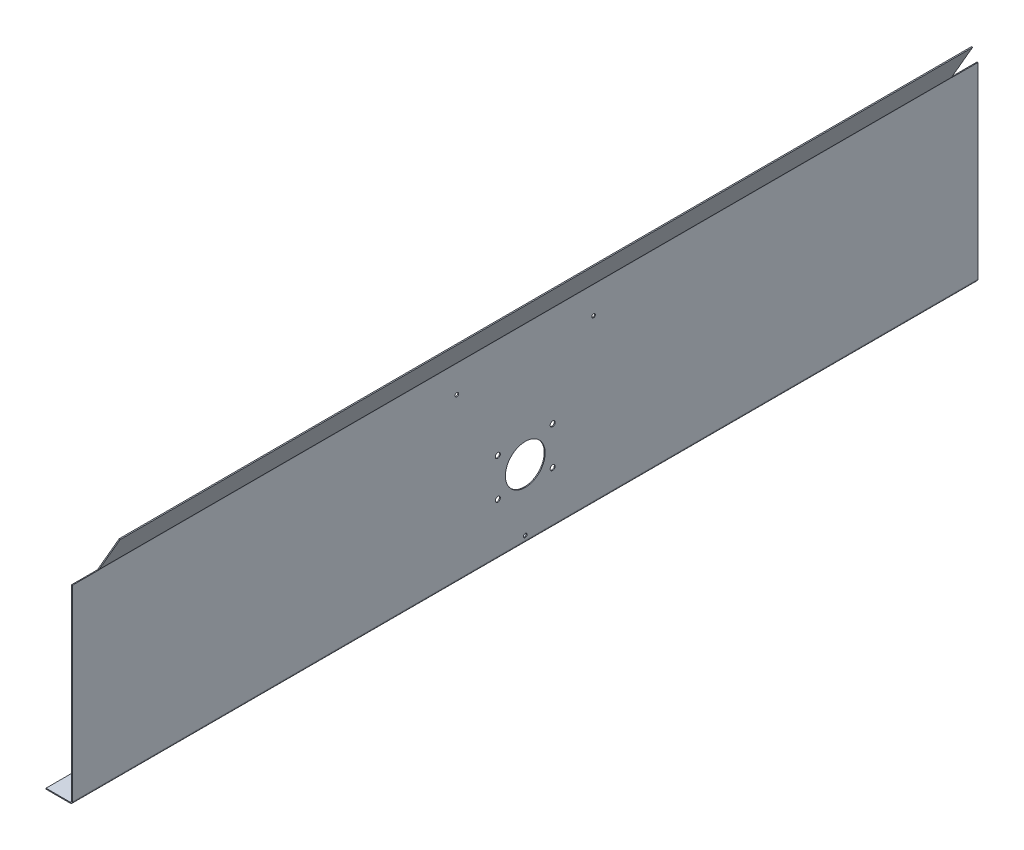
ISO-10303-21;
HEADER;
FILE_DESCRIPTION(('STEP AP214'),'2;1');
FILE_NAME('part.step','',(''),(''),'','','');
FILE_SCHEMA(('AUTOMOTIVE_DESIGN { 1 0 10303 214 1 1 1 1 }'));
ENDSEC;
DATA;
#1=APPLICATION_CONTEXT('core data for automotive mechanical design processes');
#2=APPLICATION_PROTOCOL_DEFINITION('international standard','automotive_design',2000,#1);
#3=PRODUCT_CONTEXT('',#1,'mechanical');
#4=PRODUCT('Part','Part','',(#3));
#5=PRODUCT_RELATED_PRODUCT_CATEGORY('part','',(#4));
#6=PRODUCT_DEFINITION_FORMATION('','',#4);
#7=PRODUCT_DEFINITION_CONTEXT('part definition',#1,'design');
#8=PRODUCT_DEFINITION('design','',#6,#7);
#9=PRODUCT_DEFINITION_SHAPE('','',#8);
#10=(LENGTH_UNIT() NAMED_UNIT(*) SI_UNIT(.MILLI.,.METRE.));
#11=(NAMED_UNIT(*) PLANE_ANGLE_UNIT() SI_UNIT($,.RADIAN.));
#12=(NAMED_UNIT(*) SI_UNIT($,.STERADIAN.) SOLID_ANGLE_UNIT());
#13=UNCERTAINTY_MEASURE_WITH_UNIT(LENGTH_MEASURE(1.E-05),#10,'distance_accuracy_value','');
#14=(GEOMETRIC_REPRESENTATION_CONTEXT(3) GLOBAL_UNCERTAINTY_ASSIGNED_CONTEXT((#13)) GLOBAL_UNIT_ASSIGNED_CONTEXT((#10,
#11,#12)) REPRESENTATION_CONTEXT('',''));
#15=CARTESIAN_POINT('',(0.,0.,0.));
#16=DIRECTION('',(0.,0.,1.));
#17=DIRECTION('',(1.,0.,0.));
#18=AXIS2_PLACEMENT_3D('',#15,#16,#17);
#19=CARTESIAN_POINT('',(0.,2.,990.));
#20=DIRECTION('',(1.,0.,0.));
#21=DIRECTION('',(0.,0.,-1.));
#22=AXIS2_PLACEMENT_3D('',#19,#20,#21);
#23=PLANE('',#22);
#24=DIRECTION('',(0.,-1.,0.));
#25=VECTOR('',#24,1.);
#26=CARTESIAN_POINT('',(0.,2.,-990.));
#27=LINE('',#26,#25);
#28=CARTESIAN_POINT('',(0.,2.,-990.));
#29=VERTEX_POINT('',#28);
#30=CARTESIAN_POINT('',(0.,0.,-990.));
#31=VERTEX_POINT('',#30);
#32=EDGE_CURVE('E216',#29,#31,#27,.T.);
#33=ORIENTED_EDGE('',*,*,#32,.T.);
#34=DIRECTION('',(0.,0.,-1.));
#35=VECTOR('',#34,1.);
#36=CARTESIAN_POINT('',(0.,0.,990.));
#37=LINE('',#36,#35);
#38=CARTESIAN_POINT('',(0.,0.,990.));
#39=VERTEX_POINT('',#38);
#40=EDGE_CURVE('E209',#39,#31,#37,.T.);
#41=ORIENTED_EDGE('',*,*,#40,.F.);
#42=DIRECTION('',(0.,-1.,0.));
#43=VECTOR('',#42,1.);
#44=CARTESIAN_POINT('',(0.,2.,990.));
#45=LINE('',#44,#43);
#46=CARTESIAN_POINT('',(0.,2.,990.));
#47=VERTEX_POINT('',#46);
#48=EDGE_CURVE('E165',#47,#39,#45,.T.);
#49=ORIENTED_EDGE('',*,*,#48,.F.);
#50=DIRECTION('',(0.,0.,-1.));
#51=VECTOR('',#50,1.);
#52=CARTESIAN_POINT('',(0.,2.,990.));
#53=LINE('',#52,#51);
#54=EDGE_CURVE('E178',#47,#29,#53,.T.);
#55=ORIENTED_EDGE('',*,*,#54,.T.);
#56=EDGE_LOOP('',(#33,#41,#49,#55));
#57=FACE_BOUND('',#56,.T.);
#58=ADVANCED_FACE('F30',(#57),#23,.F.);
#59=CARTESIAN_POINT('',(0.,0.,990.));
#60=DIRECTION('',(0.,1.,0.));
#61=DIRECTION('',(0.,0.,1.));
#62=AXIS2_PLACEMENT_3D('',#59,#60,#61);
#63=PLANE('',#62);
#64=DIRECTION('',(1.,0.,0.));
#65=VECTOR('',#64,1.);
#66=CARTESIAN_POINT('',(0.,0.,-990.));
#67=LINE('',#66,#65);
#68=CARTESIAN_POINT('',(53.,0.,-990.));
#69=VERTEX_POINT('',#68);
#70=EDGE_CURVE('E305',#31,#69,#67,.T.);
#71=ORIENTED_EDGE('',*,*,#70,.T.);
#72=DIRECTION('',(0.,0.,-1.));
#73=VECTOR('',#72,1.);
#74=CARTESIAN_POINT('',(53.,0.,990.));
#75=LINE('',#74,#73);
#76=CARTESIAN_POINT('',(53.,0.,990.));
#77=VERTEX_POINT('',#76);
#78=EDGE_CURVE('E206',#77,#69,#75,.T.);
#79=ORIENTED_EDGE('',*,*,#78,.F.);
#80=DIRECTION('',(1.,0.,0.));
#81=VECTOR('',#80,1.);
#82=CARTESIAN_POINT('',(0.,0.,990.));
#83=LINE('',#82,#81);
#84=EDGE_CURVE('E167',#39,#77,#83,.T.);
#85=ORIENTED_EDGE('',*,*,#84,.F.);
#86=ORIENTED_EDGE('',*,*,#40,.T.);
#87=EDGE_LOOP('',(#71,#79,#85,#86));
#88=FACE_BOUND('',#87,.T.);
#89=ADVANCED_FACE('F323',(#88),#63,.F.);
#90=CARTESIAN_POINT('',(53.,5.,990.));
#91=DIRECTION('',(0.,0.,-1.));
#92=DIRECTION('',(-1.,0.,0.));
#93=AXIS2_PLACEMENT_3D('',#90,#91,#92);
#94=CYLINDRICAL_SURFACE('',#93,5.);
#95=CARTESIAN_POINT('',(53.,5.,-990.));
#96=DIRECTION('',(0.,0.,1.));
#97=DIRECTION('',(1.,0.,0.));
#98=AXIS2_PLACEMENT_3D('',#95,#96,#97);
#99=CIRCLE('',#98,5.);
#100=CARTESIAN_POINT('',(58.,5.,-990.));
#101=VERTEX_POINT('',#100);
#102=EDGE_CURVE('E160',#69,#101,#99,.T.);
#103=ORIENTED_EDGE('',*,*,#102,.T.);
#104=DIRECTION('',(0.,0.,-1.));
#105=VECTOR('',#104,1.);
#106=CARTESIAN_POINT('',(58.,5.,990.));
#107=LINE('',#106,#105);
#108=CARTESIAN_POINT('',(58.,5.,990.));
#109=VERTEX_POINT('',#108);
#110=EDGE_CURVE('E203',#109,#101,#107,.T.);
#111=ORIENTED_EDGE('',*,*,#110,.F.);
#112=CARTESIAN_POINT('',(53.,5.,990.));
#113=DIRECTION('',(0.,0.,1.));
#114=DIRECTION('',(1.,0.,0.));
#115=AXIS2_PLACEMENT_3D('',#112,#113,#114);
#116=CIRCLE('',#115,5.);
#117=EDGE_CURVE('E169',#77,#109,#116,.T.);
#118=ORIENTED_EDGE('',*,*,#117,.F.);
#119=ORIENTED_EDGE('',*,*,#78,.T.);
#120=EDGE_LOOP('',(#103,#111,#118,#119));
#121=FACE_BOUND('',#120,.T.);
#122=ADVANCED_FACE('F309',(#121),#94,.T.);
#123=CARTESIAN_POINT('',(58.,5.,990.));
#124=DIRECTION('',(-1.,0.,0.));
#125=DIRECTION('',(0.,-1.,0.));
#126=AXIS2_PLACEMENT_3D('',#123,#124,#125);
#127=PLANE('',#126);
#128=CARTESIAN_POINT('',(58.,356.,-149.5));
#129=DIRECTION('',(1.,0.,0.));
#130=DIRECTION('',(0.,-1.,0.));
#131=AXIS2_PLACEMENT_3D('',#128,#129,#130);
#132=CIRCLE('',#131,3.99999999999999);
#133=CARTESIAN_POINT('',(58.,352.,-149.5));
#134=VERTEX_POINT('',#133);
#135=EDGE_CURVE('E245',#134,#134,#132,.T.);
#136=ORIENTED_EDGE('',*,*,#135,.F.);
#137=EDGE_LOOP('',(#136));
#138=FACE_BOUND('',#137,.T.);
#139=CARTESIAN_POINT('',(58.,356.,149.5));
#140=DIRECTION('',(1.,0.,0.));
#141=DIRECTION('',(0.,1.,0.));
#142=AXIS2_PLACEMENT_3D('',#139,#140,#141);
#143=CIRCLE('',#142,3.99999999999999);
#144=CARTESIAN_POINT('',(58.,360.,149.5));
#145=VERTEX_POINT('',#144);
#146=EDGE_CURVE('E241',#145,#145,#143,.T.);
#147=ORIENTED_EDGE('',*,*,#146,.F.);
#148=EDGE_LOOP('',(#147));
#149=FACE_BOUND('',#148,.T.);
#150=CARTESIAN_POINT('',(58.,14.5,0.));
#151=DIRECTION('',(1.,0.,0.));
#152=DIRECTION('',(0.,1.,0.));
#153=AXIS2_PLACEMENT_3D('',#150,#151,#152);
#154=CIRCLE('',#153,4.00000000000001);
#155=CARTESIAN_POINT('',(58.,18.5,0.));
#156=VERTEX_POINT('',#155);
#157=EDGE_CURVE('E237',#156,#156,#154,.T.);
#158=ORIENTED_EDGE('',*,*,#157,.F.);
#159=EDGE_LOOP('',(#158));
#160=FACE_BOUND('',#159,.T.);
#161=CARTESIAN_POINT('',(58.,113.,-60.));
#162=DIRECTION('',(1.,0.,0.));
#163=DIRECTION('',(0.,-1.,0.));
#164=AXIS2_PLACEMENT_3D('',#161,#162,#163);
#165=CIRCLE('',#164,5.5);
#166=CARTESIAN_POINT('',(58.,107.5,-60.));
#167=VERTEX_POINT('',#166);
#168=EDGE_CURVE('E233',#167,#167,#165,.T.);
#169=ORIENTED_EDGE('',*,*,#168,.F.);
#170=EDGE_LOOP('',(#169));
#171=FACE_BOUND('',#170,.T.);
#172=CARTESIAN_POINT('',(58.,196.,-60.));
#173=DIRECTION('',(1.,0.,0.));
#174=DIRECTION('',(0.,1.,0.));
#175=AXIS2_PLACEMENT_3D('',#172,#173,#174);
#176=CIRCLE('',#175,5.5);
#177=CARTESIAN_POINT('',(58.,201.5,-60.));
#178=VERTEX_POINT('',#177);
#179=EDGE_CURVE('E229',#178,#178,#176,.T.);
#180=ORIENTED_EDGE('',*,*,#179,.F.);
#181=EDGE_LOOP('',(#180));
#182=FACE_BOUND('',#181,.T.);
#183=CARTESIAN_POINT('',(58.,196.,60.));
#184=DIRECTION('',(1.,0.,0.));
#185=DIRECTION('',(0.,-1.,0.));
#186=AXIS2_PLACEMENT_3D('',#183,#184,#185);
#187=CIRCLE('',#186,5.5);
#188=CARTESIAN_POINT('',(58.,190.5,60.));
#189=VERTEX_POINT('',#188);
#190=EDGE_CURVE('E225',#189,#189,#187,.T.);
#191=ORIENTED_EDGE('',*,*,#190,.F.);
#192=EDGE_LOOP('',(#191));
#193=FACE_BOUND('',#192,.T.);
#194=CARTESIAN_POINT('',(58.,113.,60.));
#195=DIRECTION('',(1.,0.,0.));
#196=DIRECTION('',(0.,1.,0.));
#197=AXIS2_PLACEMENT_3D('',#194,#195,#196);
#198=CIRCLE('',#197,5.5);
#199=CARTESIAN_POINT('',(58.,118.5,60.));
#200=VERTEX_POINT('',#199);
#201=EDGE_CURVE('E221',#200,#200,#198,.T.);
#202=ORIENTED_EDGE('',*,*,#201,.F.);
#203=EDGE_LOOP('',(#202));
#204=FACE_BOUND('',#203,.T.);
#205=CARTESIAN_POINT('',(58.,149.,0.));
#206=DIRECTION('',(1.,0.,0.));
#207=DIRECTION('',(0.,1.,0.));
#208=AXIS2_PLACEMENT_3D('',#205,#206,#207);
#209=CIRCLE('',#208,43.5);
#210=CARTESIAN_POINT('',(58.,192.5,0.));
#211=VERTEX_POINT('',#210);
#212=EDGE_CURVE('E217',#211,#211,#209,.T.);
#213=ORIENTED_EDGE('',*,*,#212,.F.);
#214=EDGE_LOOP('',(#213));
#215=FACE_BOUND('',#214,.T.);
#216=DIRECTION('',(0.,1.,0.));
#217=VECTOR('',#216,1.);
#218=CARTESIAN_POINT('',(58.,5.,-990.));
#219=LINE('',#218,#217);
#220=CARTESIAN_POINT('',(58.,415.330127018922,-990.));
#221=VERTEX_POINT('',#220);
#222=EDGE_CURVE('E156',#101,#221,#219,.T.);
#223=ORIENTED_EDGE('',*,*,#222,.T.);
#224=DIRECTION('',(0.,0.,-1.));
#225=VECTOR('',#224,1.);
#226=CARTESIAN_POINT('',(58.,415.330127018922,990.));
#227=LINE('',#226,#225);
#228=CARTESIAN_POINT('',(58.,415.330127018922,-932.));
#229=VERTEX_POINT('',#228);
#230=EDGE_CURVE('E135',#221,#229,#227,.F.);
#231=ORIENTED_EDGE('',*,*,#230,.T.);
#232=DIRECTION('',(0.,0.,-1.));
#233=VECTOR('',#232,1.);
#234=CARTESIAN_POINT('',(58.,415.330127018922,990.));
#235=LINE('',#234,#233);
#236=CARTESIAN_POINT('',(58.,415.330127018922,932.));
#237=VERTEX_POINT('',#236);
#238=EDGE_CURVE('E200',#237,#229,#235,.T.);
#239=ORIENTED_EDGE('',*,*,#238,.F.);
#240=CARTESIAN_POINT('',(58.,415.330127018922,990.));
#241=VERTEX_POINT('',#240);
#242=EDGE_CURVE('E201',#241,#237,#235,.T.);
#243=ORIENTED_EDGE('',*,*,#242,.F.);
#244=DIRECTION('',(0.,1.,0.));
#245=VECTOR('',#244,1.);
#246=CARTESIAN_POINT('',(58.,5.,990.));
#247=LINE('',#246,#245);
#248=EDGE_CURVE('E171',#109,#241,#247,.T.);
#249=ORIENTED_EDGE('',*,*,#248,.F.);
#250=ORIENTED_EDGE('',*,*,#110,.T.);
#251=EDGE_LOOP('',(#223,#231,#239,#243,#249,#250));
#252=FACE_BOUND('',#251,.T.);
#253=ADVANCED_FACE('F314',(#138,#149,#160,#171,#182,#193,#204,#215,#252),#127,.F.);
#254=CARTESIAN_POINT('',(60.5,415.330127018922,990.));
#255=DIRECTION('',(0.,0.,-1.));
#256=DIRECTION('',(-1.,0.,0.));
#257=AXIS2_PLACEMENT_3D('',#254,#255,#256);
#258=CYLINDRICAL_SURFACE('',#257,2.5);
#259=ORIENTED_EDGE('',*,*,#238,.T.);
#260=CARTESIAN_POINT('',(60.5,415.330127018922,-932.));
#261=DIRECTION('',(0.,0.,1.));
#262=DIRECTION('',(1.,0.,0.));
#263=AXIS2_PLACEMENT_3D('',#260,#261,#262);
#264=CIRCLE('',#263,2.5);
#265=CARTESIAN_POINT('',(58.3349364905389,416.580127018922,-932.));
#266=VERTEX_POINT('',#265);
#267=EDGE_CURVE('E272',#229,#266,#264,.F.);
#268=ORIENTED_EDGE('',*,*,#267,.T.);
#269=DIRECTION('',(0.,0.,-1.));
#270=VECTOR('',#269,1.);
#271=CARTESIAN_POINT('',(58.3349364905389,416.580127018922,990.));
#272=LINE('',#271,#270);
#273=CARTESIAN_POINT('',(58.3349364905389,416.580127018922,932.));
#274=VERTEX_POINT('',#273);
#275=EDGE_CURVE('E197',#274,#266,#272,.T.);
#276=ORIENTED_EDGE('',*,*,#275,.F.);
#277=CARTESIAN_POINT('',(60.5,415.330127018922,932.));
#278=DIRECTION('',(0.,0.,-1.));
#279=DIRECTION('',(-1.,0.,0.));
#280=AXIS2_PLACEMENT_3D('',#277,#278,#279);
#281=CIRCLE('',#280,2.5);
#282=EDGE_CURVE('E284',#274,#237,#281,.F.);
#283=ORIENTED_EDGE('',*,*,#282,.T.);
#284=EDGE_LOOP('',(#259,#268,#276,#283));
#285=FACE_BOUND('',#284,.T.);
#286=ADVANCED_FACE('F336',(#285),#258,.F.);
#287=CARTESIAN_POINT('',(58.3349364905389,416.580127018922,990.));
#288=DIRECTION('',(-0.866025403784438,0.500000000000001,0.));
#289=DIRECTION('',(-0.500000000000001,-0.866025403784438,0.));
#290=AXIS2_PLACEMENT_3D('',#287,#288,#289);
#291=PLANE('',#290);
#292=ORIENTED_EDGE('',*,*,#275,.T.);
#293=DIRECTION('',(0.500000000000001,0.866025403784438,0.));
#294=VECTOR('',#293,1.);
#295=CARTESIAN_POINT('',(58.3349364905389,416.580127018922,-932.));
#296=LINE('',#295,#294);
#297=CARTESIAN_POINT('',(104.,495.674337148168,-932.));
#298=VERTEX_POINT('',#297);
#299=EDGE_CURVE('E265',#266,#298,#296,.T.);
#300=ORIENTED_EDGE('',*,*,#299,.T.);
#301=DIRECTION('',(0.,0.,-1.));
#302=VECTOR('',#301,1.);
#303=CARTESIAN_POINT('',(104.,495.674337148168,990.));
#304=LINE('',#303,#302);
#305=CARTESIAN_POINT('',(104.,495.674337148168,932.));
#306=VERTEX_POINT('',#305);
#307=EDGE_CURVE('E194',#306,#298,#304,.T.);
#308=ORIENTED_EDGE('',*,*,#307,.F.);
#309=DIRECTION('',(-0.500000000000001,-0.866025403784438,0.));
#310=VECTOR('',#309,1.);
#311=CARTESIAN_POINT('',(58.3349364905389,416.580127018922,932.));
#312=LINE('',#311,#310);
#313=EDGE_CURVE('E281',#306,#274,#312,.T.);
#314=ORIENTED_EDGE('',*,*,#313,.T.);
#315=EDGE_LOOP('',(#292,#300,#308,#314));
#316=FACE_BOUND('',#315,.T.);
#317=ADVANCED_FACE('F338',(#316),#291,.F.);
#318=CARTESIAN_POINT('',(102.267949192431,496.674337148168,990.));
#319=DIRECTION('',(-0.500000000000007,-0.866025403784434,0.));
#320=DIRECTION('',(0.866025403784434,-0.500000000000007,0.));
#321=AXIS2_PLACEMENT_3D('',#318,#319,#320);
#322=PLANE('',#321);
#323=ORIENTED_EDGE('',*,*,#307,.T.);
#324=DIRECTION('',(-0.866025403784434,0.500000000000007,0.));
#325=VECTOR('',#324,1.);
#326=CARTESIAN_POINT('',(102.267949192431,496.674337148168,-932.));
#327=LINE('',#326,#325);
#328=CARTESIAN_POINT('',(102.267949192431,496.674337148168,-932.));
#329=VERTEX_POINT('',#328);
#330=EDGE_CURVE('E263',#298,#329,#327,.T.);
#331=ORIENTED_EDGE('',*,*,#330,.T.);
#332=DIRECTION('',(0.,0.,-1.));
#333=VECTOR('',#332,1.);
#334=CARTESIAN_POINT('',(102.267949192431,496.674337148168,990.));
#335=LINE('',#334,#333);
#336=CARTESIAN_POINT('',(102.267949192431,496.674337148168,932.));
#337=VERTEX_POINT('',#336);
#338=EDGE_CURVE('E191',#337,#329,#335,.T.);
#339=ORIENTED_EDGE('',*,*,#338,.F.);
#340=DIRECTION('',(0.866025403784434,-0.500000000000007,0.));
#341=VECTOR('',#340,1.);
#342=CARTESIAN_POINT('',(102.267949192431,496.674337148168,932.));
#343=LINE('',#342,#341);
#344=EDGE_CURVE('E278',#337,#306,#343,.T.);
#345=ORIENTED_EDGE('',*,*,#344,.T.);
#346=EDGE_LOOP('',(#323,#331,#339,#345));
#347=FACE_BOUND('',#346,.T.);
#348=ADVANCED_FACE('F341',(#347),#322,.F.);
#349=CARTESIAN_POINT('',(56.60288568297,417.580127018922,990.));
#350=DIRECTION('',(0.866025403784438,-0.5,0.));
#351=DIRECTION('',(0.5,0.866025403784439,0.));
#352=AXIS2_PLACEMENT_3D('',#349,#350,#351);
#353=PLANE('',#352);
#354=ORIENTED_EDGE('',*,*,#338,.T.);
#355=DIRECTION('',(-0.5,-0.866025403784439,0.));
#356=VECTOR('',#355,1.);
#357=CARTESIAN_POINT('',(56.60288568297,417.580127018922,-932.));
#358=LINE('',#357,#356);
#359=CARTESIAN_POINT('',(56.60288568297,417.580127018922,-932.));
#360=VERTEX_POINT('',#359);
#361=EDGE_CURVE('E260',#329,#360,#358,.T.);
#362=ORIENTED_EDGE('',*,*,#361,.T.);
#363=DIRECTION('',(0.,0.,-1.));
#364=VECTOR('',#363,1.);
#365=CARTESIAN_POINT('',(56.60288568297,417.580127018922,990.));
#366=LINE('',#365,#364);
#367=CARTESIAN_POINT('',(56.60288568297,417.580127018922,932.));
#368=VERTEX_POINT('',#367);
#369=EDGE_CURVE('E188',#368,#360,#366,.T.);
#370=ORIENTED_EDGE('',*,*,#369,.F.);
#371=DIRECTION('',(0.5,0.866025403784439,0.));
#372=VECTOR('',#371,1.);
#373=CARTESIAN_POINT('',(56.60288568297,417.580127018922,932.));
#374=LINE('',#373,#372);
#375=EDGE_CURVE('E258',#368,#337,#374,.T.);
#376=ORIENTED_EDGE('',*,*,#375,.T.);
#377=EDGE_LOOP('',(#354,#362,#370,#376));
#378=FACE_BOUND('',#377,.T.);
#379=ADVANCED_FACE('F257',(#378),#353,.F.);
#380=CARTESIAN_POINT('',(60.5,415.330127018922,990.));
#381=DIRECTION('',(0.,0.,-1.));
#382=DIRECTION('',(-1.,0.,0.));
#383=AXIS2_PLACEMENT_3D('',#380,#381,#382);
#384=CYLINDRICAL_SURFACE('',#383,4.5);
#385=ORIENTED_EDGE('',*,*,#369,.T.);
#386=CARTESIAN_POINT('',(60.5,415.330127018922,-932.));
#387=DIRECTION('',(0.,0.,1.));
#388=DIRECTION('',(1.,0.,0.));
#389=AXIS2_PLACEMENT_3D('',#386,#387,#388);
#390=CIRCLE('',#389,4.5);
#391=CARTESIAN_POINT('',(56.,415.330127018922,-932.));
#392=VERTEX_POINT('',#391);
#393=EDGE_CURVE('E11',#360,#392,#390,.T.);
#394=ORIENTED_EDGE('',*,*,#393,.T.);
#395=DIRECTION('',(0.,0.,-1.));
#396=VECTOR('',#395,1.);
#397=CARTESIAN_POINT('',(56.,415.330127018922,990.));
#398=LINE('',#397,#396);
#399=CARTESIAN_POINT('',(56.,415.330127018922,932.));
#400=VERTEX_POINT('',#399);
#401=EDGE_CURVE('E149',#400,#392,#398,.T.);
#402=ORIENTED_EDGE('',*,*,#401,.F.);
#403=CARTESIAN_POINT('',(60.5,415.330127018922,932.));
#404=DIRECTION('',(0.,0.,-1.));
#405=DIRECTION('',(-1.,0.,0.));
#406=AXIS2_PLACEMENT_3D('',#403,#404,#405);
#407=CIRCLE('',#406,4.5);
#408=EDGE_CURVE('E140',#400,#368,#407,.T.);
#409=ORIENTED_EDGE('',*,*,#408,.T.);
#410=EDGE_LOOP('',(#385,#394,#402,#409));
#411=FACE_BOUND('',#410,.T.);
#412=ADVANCED_FACE('F250',(#411),#384,.T.);
#413=CARTESIAN_POINT('',(56.,5.,990.));
#414=DIRECTION('',(1.,0.,0.));
#415=DIRECTION('',(0.,1.,0.));
#416=AXIS2_PLACEMENT_3D('',#413,#414,#415);
#417=PLANE('',#416);
#418=CARTESIAN_POINT('',(56.,356.,-149.5));
#419=DIRECTION('',(1.,0.,0.));
#420=DIRECTION('',(0.,1.,0.));
#421=AXIS2_PLACEMENT_3D('',#418,#419,#420);
#422=CIRCLE('',#421,3.99999999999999);
#423=CARTESIAN_POINT('',(56.,360.,-149.5));
#424=VERTEX_POINT('',#423);
#425=EDGE_CURVE('E242',#424,#424,#422,.T.);
#426=ORIENTED_EDGE('',*,*,#425,.T.);
#427=EDGE_LOOP('',(#426));
#428=FACE_BOUND('',#427,.T.);
#429=CARTESIAN_POINT('',(56.,356.,149.5));
#430=DIRECTION('',(1.,0.,0.));
#431=DIRECTION('',(0.,1.,0.));
#432=AXIS2_PLACEMENT_3D('',#429,#430,#431);
#433=CIRCLE('',#432,3.99999999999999);
#434=CARTESIAN_POINT('',(56.,360.,149.5));
#435=VERTEX_POINT('',#434);
#436=EDGE_CURVE('E238',#435,#435,#433,.T.);
#437=ORIENTED_EDGE('',*,*,#436,.T.);
#438=EDGE_LOOP('',(#437));
#439=FACE_BOUND('',#438,.T.);
#440=CARTESIAN_POINT('',(56.,14.5,0.));
#441=DIRECTION('',(1.,0.,0.));
#442=DIRECTION('',(0.,1.,0.));
#443=AXIS2_PLACEMENT_3D('',#440,#441,#442);
#444=CIRCLE('',#443,4.00000000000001);
#445=CARTESIAN_POINT('',(56.,18.5,0.));
#446=VERTEX_POINT('',#445);
#447=EDGE_CURVE('E234',#446,#446,#444,.T.);
#448=ORIENTED_EDGE('',*,*,#447,.T.);
#449=EDGE_LOOP('',(#448));
#450=FACE_BOUND('',#449,.T.);
#451=CARTESIAN_POINT('',(56.,113.,-60.));
#452=DIRECTION('',(1.,0.,0.));
#453=DIRECTION('',(0.,1.,0.));
#454=AXIS2_PLACEMENT_3D('',#451,#452,#453);
#455=CIRCLE('',#454,5.5);
#456=CARTESIAN_POINT('',(56.,118.5,-60.));
#457=VERTEX_POINT('',#456);
#458=EDGE_CURVE('E230',#457,#457,#455,.T.);
#459=ORIENTED_EDGE('',*,*,#458,.T.);
#460=EDGE_LOOP('',(#459));
#461=FACE_BOUND('',#460,.T.);
#462=CARTESIAN_POINT('',(56.,196.,-60.));
#463=DIRECTION('',(1.,0.,0.));
#464=DIRECTION('',(0.,1.,0.));
#465=AXIS2_PLACEMENT_3D('',#462,#463,#464);
#466=CIRCLE('',#465,5.5);
#467=CARTESIAN_POINT('',(56.,201.5,-60.));
#468=VERTEX_POINT('',#467);
#469=EDGE_CURVE('E226',#468,#468,#466,.T.);
#470=ORIENTED_EDGE('',*,*,#469,.T.);
#471=EDGE_LOOP('',(#470));
#472=FACE_BOUND('',#471,.T.);
#473=CARTESIAN_POINT('',(56.,196.,60.));
#474=DIRECTION('',(1.,0.,0.));
#475=DIRECTION('',(0.,1.,0.));
#476=AXIS2_PLACEMENT_3D('',#473,#474,#475);
#477=CIRCLE('',#476,5.5);
#478=CARTESIAN_POINT('',(56.,201.5,60.));
#479=VERTEX_POINT('',#478);
#480=EDGE_CURVE('E222',#479,#479,#477,.T.);
#481=ORIENTED_EDGE('',*,*,#480,.T.);
#482=EDGE_LOOP('',(#481));
#483=FACE_BOUND('',#482,.T.);
#484=CARTESIAN_POINT('',(56.,113.,60.));
#485=DIRECTION('',(1.,0.,0.));
#486=DIRECTION('',(0.,1.,0.));
#487=AXIS2_PLACEMENT_3D('',#484,#485,#486);
#488=CIRCLE('',#487,5.5);
#489=CARTESIAN_POINT('',(56.,118.5,60.));
#490=VERTEX_POINT('',#489);
#491=EDGE_CURVE('E218',#490,#490,#488,.T.);
#492=ORIENTED_EDGE('',*,*,#491,.T.);
#493=EDGE_LOOP('',(#492));
#494=FACE_BOUND('',#493,.T.);
#495=CARTESIAN_POINT('',(56.,149.,0.));
#496=DIRECTION('',(1.,0.,0.));
#497=DIRECTION('',(0.,1.,0.));
#498=AXIS2_PLACEMENT_3D('',#495,#496,#497);
#499=CIRCLE('',#498,43.5);
#500=CARTESIAN_POINT('',(56.,192.5,0.));
#501=VERTEX_POINT('',#500);
#502=EDGE_CURVE('E213',#501,#501,#499,.T.);
#503=ORIENTED_EDGE('',*,*,#502,.T.);
#504=EDGE_LOOP('',(#503));
#505=FACE_BOUND('',#504,.T.);
#506=DIRECTION('',(0.,-1.,0.));
#507=VECTOR('',#506,1.);
#508=CARTESIAN_POINT('',(56.,5.,-990.));
#509=LINE('',#508,#507);
#510=CARTESIAN_POINT('',(56.,415.330127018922,-990.));
#511=VERTEX_POINT('',#510);
#512=CARTESIAN_POINT('',(56.,5.,-990.));
#513=VERTEX_POINT('',#512);
#514=EDGE_CURVE('E145',#511,#513,#509,.T.);
#515=ORIENTED_EDGE('',*,*,#514,.T.);
#516=DIRECTION('',(0.,0.,-1.));
#517=VECTOR('',#516,1.);
#518=CARTESIAN_POINT('',(56.,5.,990.));
#519=LINE('',#518,#517);
#520=CARTESIAN_POINT('',(56.,5.,990.));
#521=VERTEX_POINT('',#520);
#522=EDGE_CURVE('E184',#521,#513,#519,.T.);
#523=ORIENTED_EDGE('',*,*,#522,.F.);
#524=DIRECTION('',(0.,-1.,0.));
#525=VECTOR('',#524,1.);
#526=CARTESIAN_POINT('',(56.,5.,990.));
#527=LINE('',#526,#525);
#528=CARTESIAN_POINT('',(56.,415.330127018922,990.));
#529=VERTEX_POINT('',#528);
#530=EDGE_CURVE('E174',#529,#521,#527,.T.);
#531=ORIENTED_EDGE('',*,*,#530,.F.);
#532=EDGE_CURVE('E186',#529,#400,#398,.T.);
#533=ORIENTED_EDGE('',*,*,#532,.T.);
#534=ORIENTED_EDGE('',*,*,#401,.T.);
#535=DIRECTION('',(0.,0.,1.));
#536=VECTOR('',#535,1.);
#537=CARTESIAN_POINT('',(56.,415.330127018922,-990.));
#538=LINE('',#537,#536);
#539=EDGE_CURVE('E133',#511,#392,#538,.T.);
#540=ORIENTED_EDGE('',*,*,#539,.F.);
#541=EDGE_LOOP('',(#515,#523,#531,#533,#534,#540));
#542=FACE_BOUND('',#541,.T.);
#543=ADVANCED_FACE('F143',(#428,#439,#450,#461,#472,#483,#494,#505,#542),#417,.F.);
#544=CARTESIAN_POINT('',(53.,5.,990.));
#545=DIRECTION('',(0.,0.,-1.));
#546=DIRECTION('',(-1.,0.,0.));
#547=AXIS2_PLACEMENT_3D('',#544,#545,#546);
#548=CYLINDRICAL_SURFACE('',#547,3.);
#549=CARTESIAN_POINT('',(53.,5.,-990.));
#550=DIRECTION('',(0.,0.,-1.));
#551=DIRECTION('',(1.,0.,0.));
#552=AXIS2_PLACEMENT_3D('',#549,#550,#551);
#553=CIRCLE('',#552,3.);
#554=CARTESIAN_POINT('',(53.,2.,-990.));
#555=VERTEX_POINT('',#554);
#556=EDGE_CURVE('E155',#513,#555,#553,.T.);
#557=ORIENTED_EDGE('',*,*,#556,.T.);
#558=DIRECTION('',(0.,0.,-1.));
#559=VECTOR('',#558,1.);
#560=CARTESIAN_POINT('',(53.,2.,990.));
#561=LINE('',#560,#559);
#562=CARTESIAN_POINT('',(53.,2.,990.));
#563=VERTEX_POINT('',#562);
#564=EDGE_CURVE('E181',#563,#555,#561,.T.);
#565=ORIENTED_EDGE('',*,*,#564,.F.);
#566=CARTESIAN_POINT('',(53.,5.,990.));
#567=DIRECTION('',(0.,0.,-1.));
#568=DIRECTION('',(1.,0.,0.));
#569=AXIS2_PLACEMENT_3D('',#566,#567,#568);
#570=CIRCLE('',#569,3.);
#571=EDGE_CURVE('E49',#521,#563,#570,.T.);
#572=ORIENTED_EDGE('',*,*,#571,.F.);
#573=ORIENTED_EDGE('',*,*,#522,.T.);
#574=EDGE_LOOP('',(#557,#565,#572,#573));
#575=FACE_BOUND('',#574,.T.);
#576=ADVANCED_FACE('F329',(#575),#548,.F.);
#577=CARTESIAN_POINT('',(0.,2.,990.));
#578=DIRECTION('',(0.,-1.,0.));
#579=DIRECTION('',(0.,0.,-1.));
#580=AXIS2_PLACEMENT_3D('',#577,#578,#579);
#581=PLANE('',#580);
#582=DIRECTION('',(-1.,0.,0.));
#583=VECTOR('',#582,1.);
#584=CARTESIAN_POINT('',(0.,2.,-990.));
#585=LINE('',#584,#583);
#586=EDGE_CURVE('E158',#555,#29,#585,.T.);
#587=ORIENTED_EDGE('',*,*,#586,.T.);
#588=ORIENTED_EDGE('',*,*,#54,.F.);
#589=DIRECTION('',(-1.,0.,0.));
#590=VECTOR('',#589,1.);
#591=CARTESIAN_POINT('',(0.,2.,990.));
#592=LINE('',#591,#590);
#593=EDGE_CURVE('E44',#563,#47,#592,.T.);
#594=ORIENTED_EDGE('',*,*,#593,.F.);
#595=ORIENTED_EDGE('',*,*,#564,.T.);
#596=EDGE_LOOP('',(#587,#588,#594,#595));
#597=FACE_BOUND('',#596,.T.);
#598=ADVANCED_FACE('F327',(#597),#581,.F.);
#599=CARTESIAN_POINT('',(53.,5.,990.));
#600=DIRECTION('',(0.,0.,1.));
#601=DIRECTION('',(1.,0.,0.));
#602=AXIS2_PLACEMENT_3D('',#599,#600,#601);
#603=PLANE('',#602);
#604=DIRECTION('',(1.,0.,0.));
#605=VECTOR('',#604,1.);
#606=CARTESIAN_POINT('',(53.,415.330127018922,990.));
#607=LINE('',#606,#605);
#608=EDGE_CURVE('E212',#529,#241,#607,.T.);
#609=ORIENTED_EDGE('',*,*,#608,.F.);
#610=ORIENTED_EDGE('',*,*,#530,.T.);
#611=ORIENTED_EDGE('',*,*,#571,.T.);
#612=ORIENTED_EDGE('',*,*,#593,.T.);
#613=ORIENTED_EDGE('',*,*,#48,.T.);
#614=ORIENTED_EDGE('',*,*,#84,.T.);
#615=ORIENTED_EDGE('',*,*,#117,.T.);
#616=ORIENTED_EDGE('',*,*,#248,.T.);
#617=EDGE_LOOP('',(#609,#610,#611,#612,#613,#614,#615,#616));
#618=FACE_BOUND('',#617,.T.);
#619=ADVANCED_FACE('F318',(#618),#603,.T.);
#620=CARTESIAN_POINT('',(53.,5.,-990.));
#621=DIRECTION('',(0.,0.,1.));
#622=DIRECTION('',(1.,0.,0.));
#623=AXIS2_PLACEMENT_3D('',#620,#621,#622);
#624=PLANE('',#623);
#625=ORIENTED_EDGE('',*,*,#514,.F.);
#626=DIRECTION('',(1.,0.,0.));
#627=VECTOR('',#626,1.);
#628=CARTESIAN_POINT('',(53.,415.330127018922,-990.));
#629=LINE('',#628,#627);
#630=EDGE_CURVE('E37',#511,#221,#629,.T.);
#631=ORIENTED_EDGE('',*,*,#630,.T.);
#632=ORIENTED_EDGE('',*,*,#222,.F.);
#633=ORIENTED_EDGE('',*,*,#102,.F.);
#634=ORIENTED_EDGE('',*,*,#70,.F.);
#635=ORIENTED_EDGE('',*,*,#32,.F.);
#636=ORIENTED_EDGE('',*,*,#586,.F.);
#637=ORIENTED_EDGE('',*,*,#556,.F.);
#638=EDGE_LOOP('',(#625,#631,#632,#633,#634,#635,#636,#637));
#639=FACE_BOUND('',#638,.T.);
#640=ADVANCED_FACE('F153',(#639),#624,.F.);
#641=CARTESIAN_POINT('',(0.,149.,0.));
#642=DIRECTION('',(1.,0.,0.));
#643=DIRECTION('',(0.,1.,0.));
#644=AXIS2_PLACEMENT_3D('',#641,#642,#643);
#645=CYLINDRICAL_SURFACE('',#644,43.5);
#646=ORIENTED_EDGE('',*,*,#212,.T.);
#647=EDGE_LOOP('',(#646));
#648=FACE_BOUND('',#647,.T.);
#649=ORIENTED_EDGE('',*,*,#502,.F.);
#650=EDGE_LOOP('',(#649));
#651=FACE_BOUND('',#650,.T.);
#652=ADVANCED_FACE('F384',(#648,#651),#645,.F.);
#653=CARTESIAN_POINT('',(0.,113.,60.));
#654=DIRECTION('',(1.,0.,0.));
#655=DIRECTION('',(0.,1.,0.));
#656=AXIS2_PLACEMENT_3D('',#653,#654,#655);
#657=CYLINDRICAL_SURFACE('',#656,5.5);
#658=ORIENTED_EDGE('',*,*,#201,.T.);
#659=EDGE_LOOP('',(#658));
#660=FACE_BOUND('',#659,.T.);
#661=ORIENTED_EDGE('',*,*,#491,.F.);
#662=EDGE_LOOP('',(#661));
#663=FACE_BOUND('',#662,.T.);
#664=ADVANCED_FACE('F387',(#660,#663),#657,.F.);
#665=CARTESIAN_POINT('',(0.,196.,60.));
#666=DIRECTION('',(1.,0.,0.));
#667=DIRECTION('',(0.,1.,0.));
#668=AXIS2_PLACEMENT_3D('',#665,#666,#667);
#669=CYLINDRICAL_SURFACE('',#668,5.5);
#670=ORIENTED_EDGE('',*,*,#190,.T.);
#671=EDGE_LOOP('',(#670));
#672=FACE_BOUND('',#671,.T.);
#673=ORIENTED_EDGE('',*,*,#480,.F.);
#674=EDGE_LOOP('',(#673));
#675=FACE_BOUND('',#674,.T.);
#676=ADVANCED_FACE('F391',(#672,#675),#669,.F.);
#677=CARTESIAN_POINT('',(0.,196.,-60.));
#678=DIRECTION('',(1.,0.,0.));
#679=DIRECTION('',(0.,1.,0.));
#680=AXIS2_PLACEMENT_3D('',#677,#678,#679);
#681=CYLINDRICAL_SURFACE('',#680,5.5);
#682=ORIENTED_EDGE('',*,*,#179,.T.);
#683=EDGE_LOOP('',(#682));
#684=FACE_BOUND('',#683,.T.);
#685=ORIENTED_EDGE('',*,*,#469,.F.);
#686=EDGE_LOOP('',(#685));
#687=FACE_BOUND('',#686,.T.);
#688=ADVANCED_FACE('F395',(#684,#687),#681,.F.);
#689=CARTESIAN_POINT('',(0.,113.,-60.));
#690=DIRECTION('',(1.,0.,0.));
#691=DIRECTION('',(0.,1.,0.));
#692=AXIS2_PLACEMENT_3D('',#689,#690,#691);
#693=CYLINDRICAL_SURFACE('',#692,5.5);
#694=ORIENTED_EDGE('',*,*,#168,.T.);
#695=EDGE_LOOP('',(#694));
#696=FACE_BOUND('',#695,.T.);
#697=ORIENTED_EDGE('',*,*,#458,.F.);
#698=EDGE_LOOP('',(#697));
#699=FACE_BOUND('',#698,.T.);
#700=ADVANCED_FACE('F399',(#696,#699),#693,.F.);
#701=CARTESIAN_POINT('',(0.,14.5,0.));
#702=DIRECTION('',(1.,0.,0.));
#703=DIRECTION('',(0.,1.,0.));
#704=AXIS2_PLACEMENT_3D('',#701,#702,#703);
#705=CYLINDRICAL_SURFACE('',#704,4.00000000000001);
#706=ORIENTED_EDGE('',*,*,#157,.T.);
#707=EDGE_LOOP('',(#706));
#708=FACE_BOUND('',#707,.T.);
#709=ORIENTED_EDGE('',*,*,#447,.F.);
#710=EDGE_LOOP('',(#709));
#711=FACE_BOUND('',#710,.T.);
#712=ADVANCED_FACE('F403',(#708,#711),#705,.F.);
#713=CARTESIAN_POINT('',(0.,356.,149.5));
#714=DIRECTION('',(1.,0.,0.));
#715=DIRECTION('',(0.,1.,0.));
#716=AXIS2_PLACEMENT_3D('',#713,#714,#715);
#717=CYLINDRICAL_SURFACE('',#716,3.99999999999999);
#718=ORIENTED_EDGE('',*,*,#146,.T.);
#719=EDGE_LOOP('',(#718));
#720=FACE_BOUND('',#719,.T.);
#721=ORIENTED_EDGE('',*,*,#436,.F.);
#722=EDGE_LOOP('',(#721));
#723=FACE_BOUND('',#722,.T.);
#724=ADVANCED_FACE('F407',(#720,#723),#717,.F.);
#725=CARTESIAN_POINT('',(0.,356.,-149.5));
#726=DIRECTION('',(1.,0.,0.));
#727=DIRECTION('',(0.,1.,0.));
#728=AXIS2_PLACEMENT_3D('',#725,#726,#727);
#729=CYLINDRICAL_SURFACE('',#728,3.99999999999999);
#730=ORIENTED_EDGE('',*,*,#135,.T.);
#731=EDGE_LOOP('',(#730));
#732=FACE_BOUND('',#731,.T.);
#733=ORIENTED_EDGE('',*,*,#425,.F.);
#734=EDGE_LOOP('',(#733));
#735=FACE_BOUND('',#734,.T.);
#736=ADVANCED_FACE('F411',(#732,#735),#729,.F.);
#737=CARTESIAN_POINT('',(104.,415.330127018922,932.));
#738=DIRECTION('',(0.,0.,-1.));
#739=DIRECTION('',(-1.,0.,0.));
#740=AXIS2_PLACEMENT_3D('',#737,#738,#739);
#741=PLANE('',#740);
#742=ORIENTED_EDGE('',*,*,#313,.F.);
#743=ORIENTED_EDGE('',*,*,#344,.F.);
#744=ORIENTED_EDGE('',*,*,#375,.F.);
#745=ORIENTED_EDGE('',*,*,#408,.F.);
#746=DIRECTION('',(-1.,0.,0.));
#747=VECTOR('',#746,1.);
#748=CARTESIAN_POINT('',(104.,415.330127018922,932.));
#749=LINE('',#748,#747);
#750=EDGE_CURVE('E275',#237,#400,#749,.T.);
#751=ORIENTED_EDGE('',*,*,#750,.F.);
#752=ORIENTED_EDGE('',*,*,#282,.F.);
#753=EDGE_LOOP('',(#742,#743,#744,#745,#751,#752));
#754=FACE_BOUND('',#753,.T.);
#755=ADVANCED_FACE('F332',(#754),#741,.F.);
#756=CARTESIAN_POINT('',(104.,415.330127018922,990.));
#757=DIRECTION('',(0.,-1.,0.));
#758=DIRECTION('',(1.,0.,0.));
#759=AXIS2_PLACEMENT_3D('',#756,#757,#758);
#760=PLANE('',#759);
#761=ORIENTED_EDGE('',*,*,#750,.T.);
#762=ORIENTED_EDGE('',*,*,#532,.F.);
#763=ORIENTED_EDGE('',*,*,#608,.T.);
#764=ORIENTED_EDGE('',*,*,#242,.T.);
#765=EDGE_LOOP('',(#761,#762,#763,#764));
#766=FACE_BOUND('',#765,.T.);
#767=ADVANCED_FACE('F331',(#766),#760,.F.);
#768=CARTESIAN_POINT('',(104.,415.330127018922,-932.));
#769=DIRECTION('',(0.,0.,1.));
#770=DIRECTION('',(1.,0.,0.));
#771=AXIS2_PLACEMENT_3D('',#768,#769,#770);
#772=PLANE('',#771);
#773=DIRECTION('',(-1.,0.,0.));
#774=VECTOR('',#773,1.);
#775=CARTESIAN_POINT('',(104.,415.330127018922,-932.));
#776=LINE('',#775,#774);
#777=EDGE_CURVE('E150',#229,#392,#776,.T.);
#778=ORIENTED_EDGE('',*,*,#777,.T.);
#779=ORIENTED_EDGE('',*,*,#393,.F.);
#780=ORIENTED_EDGE('',*,*,#361,.F.);
#781=ORIENTED_EDGE('',*,*,#330,.F.);
#782=ORIENTED_EDGE('',*,*,#299,.F.);
#783=ORIENTED_EDGE('',*,*,#267,.F.);
#784=EDGE_LOOP('',(#778,#779,#780,#781,#782,#783));
#785=FACE_BOUND('',#784,.T.);
#786=ADVANCED_FACE('F342',(#785),#772,.F.);
#787=CARTESIAN_POINT('',(104.,415.330127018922,-990.));
#788=DIRECTION('',(0.,-1.,0.));
#789=DIRECTION('',(1.,0.,0.));
#790=AXIS2_PLACEMENT_3D('',#787,#788,#789);
#791=PLANE('',#790);
#792=ORIENTED_EDGE('',*,*,#630,.F.);
#793=ORIENTED_EDGE('',*,*,#539,.T.);
#794=ORIENTED_EDGE('',*,*,#777,.F.);
#795=ORIENTED_EDGE('',*,*,#230,.F.);
#796=EDGE_LOOP('',(#792,#793,#794,#795));
#797=FACE_BOUND('',#796,.T.);
#798=ADVANCED_FACE('F131',(#797),#791,.F.);
#799=CLOSED_SHELL('',(#58,#89,#122,#253,#286,#317,#348,#379,#412,#543,#576,#598,#619,#640,#652,
#664,#676,#688,#700,#712,#724,#736,#755,#767,#786,#798));
#800=MANIFOLD_SOLID_BREP('B2',#799);
#801=ADVANCED_BREP_SHAPE_REPRESENTATION('',(#18,#800),#14);
#802=SHAPE_DEFINITION_REPRESENTATION(#9,#801);
ENDSEC;
END-ISO-10303-21;
